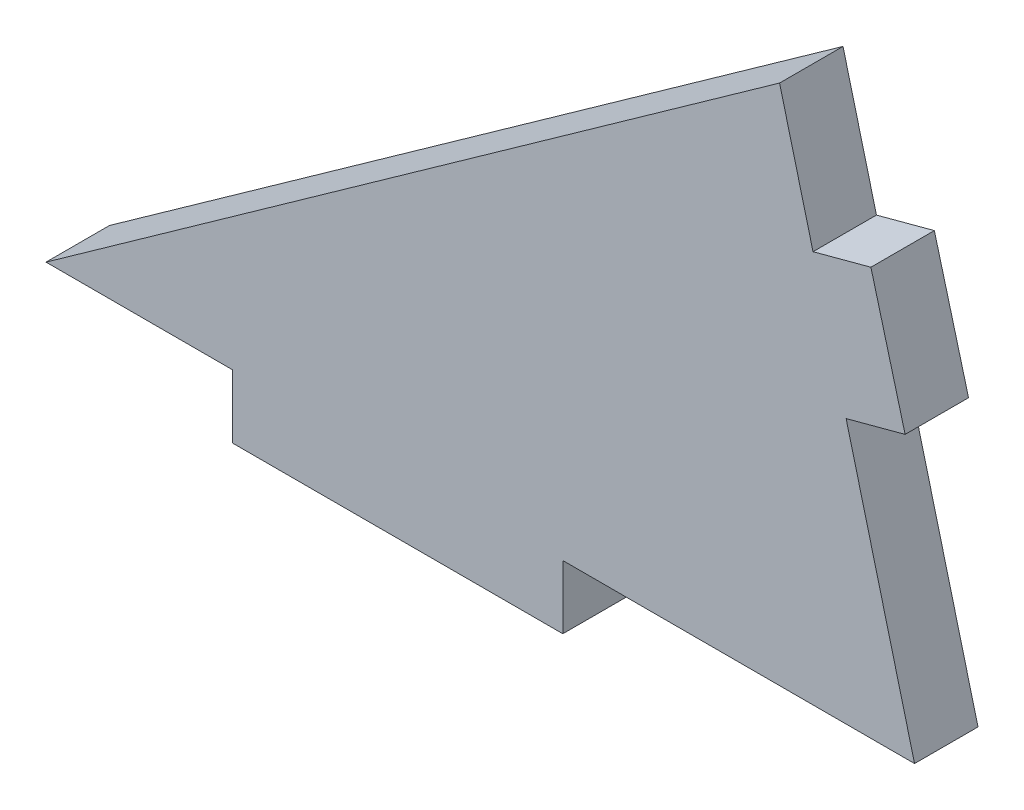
ISO-10303-21;
HEADER;
FILE_DESCRIPTION(('STEP AP214'),'2;1');
FILE_NAME('part.step','',(''),(''),'','','');
FILE_SCHEMA(('AUTOMOTIVE_DESIGN { 1 0 10303 214 1 1 1 1 }'));
ENDSEC;
DATA;
#1=APPLICATION_CONTEXT('core data for automotive mechanical design processes');
#2=APPLICATION_PROTOCOL_DEFINITION('international standard','automotive_design',2000,#1);
#3=PRODUCT_CONTEXT('',#1,'mechanical');
#4=PRODUCT('Part','Part','',(#3));
#5=PRODUCT_RELATED_PRODUCT_CATEGORY('part','',(#4));
#6=PRODUCT_DEFINITION_FORMATION('','',#4);
#7=PRODUCT_DEFINITION_CONTEXT('part definition',#1,'design');
#8=PRODUCT_DEFINITION('design','',#6,#7);
#9=PRODUCT_DEFINITION_SHAPE('','',#8);
#10=(LENGTH_UNIT() NAMED_UNIT(*) SI_UNIT(.MILLI.,.METRE.));
#11=(NAMED_UNIT(*) PLANE_ANGLE_UNIT() SI_UNIT($,.RADIAN.));
#12=(NAMED_UNIT(*) SI_UNIT($,.STERADIAN.) SOLID_ANGLE_UNIT());
#13=UNCERTAINTY_MEASURE_WITH_UNIT(LENGTH_MEASURE(1.E-05),#10,'distance_accuracy_value','');
#14=(GEOMETRIC_REPRESENTATION_CONTEXT(3) GLOBAL_UNCERTAINTY_ASSIGNED_CONTEXT((#13)) GLOBAL_UNIT_ASSIGNED_CONTEXT((#10,
#11,#12)) REPRESENTATION_CONTEXT('',''));
#15=CARTESIAN_POINT('',(0.,0.,0.));
#16=DIRECTION('',(0.,0.,1.));
#17=DIRECTION('',(1.,0.,0.));
#18=AXIS2_PLACEMENT_3D('',#15,#16,#17);
#19=CARTESIAN_POINT('',(13.0177123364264,-1.524,1.524));
#20=DIRECTION('',(1.,0.,0.));
#21=DIRECTION('',(0.,0.,-1.));
#22=AXIS2_PLACEMENT_3D('',#19,#20,#21);
#23=PLANE('',#22);
#24=DIRECTION('',(0.,-1.,0.));
#25=VECTOR('',#24,1.);
#26=CARTESIAN_POINT('',(13.0177123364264,-1.524,0.));
#27=LINE('',#26,#25);
#28=CARTESIAN_POINT('',(13.0177123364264,0.,0.));
#29=VERTEX_POINT('',#28);
#30=CARTESIAN_POINT('',(13.0177123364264,-1.524,0.));
#31=VERTEX_POINT('',#30);
#32=EDGE_CURVE('E150',#29,#31,#27,.T.);
#33=ORIENTED_EDGE('',*,*,#32,.T.);
#34=DIRECTION('',(0.,0.,-1.));
#35=VECTOR('',#34,1.);
#36=CARTESIAN_POINT('',(13.0177123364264,-1.524,1.524));
#37=LINE('',#36,#35);
#38=CARTESIAN_POINT('',(13.0177123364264,-1.524,1.524));
#39=VERTEX_POINT('',#38);
#40=EDGE_CURVE('E11',#39,#31,#37,.T.);
#41=ORIENTED_EDGE('',*,*,#40,.F.);
#42=DIRECTION('',(0.,-1.,0.));
#43=VECTOR('',#42,1.);
#44=CARTESIAN_POINT('',(13.0177123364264,-1.524,1.524));
#45=LINE('',#44,#43);
#46=CARTESIAN_POINT('',(13.0177123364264,0.,1.524));
#47=VERTEX_POINT('',#46);
#48=EDGE_CURVE('E170',#47,#39,#45,.T.);
#49=ORIENTED_EDGE('',*,*,#48,.F.);
#50=DIRECTION('',(0.,0.,-1.));
#51=VECTOR('',#50,1.);
#52=CARTESIAN_POINT('',(13.0177123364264,0.,1.524));
#53=LINE('',#52,#51);
#54=EDGE_CURVE('E146',#47,#29,#53,.T.);
#55=ORIENTED_EDGE('',*,*,#54,.T.);
#56=EDGE_LOOP('',(#33,#41,#49,#55));
#57=FACE_BOUND('',#56,.T.);
#58=ADVANCED_FACE('F36',(#57),#23,.F.);
#59=CARTESIAN_POINT('',(13.0177123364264,-1.524,1.524));
#60=DIRECTION('',(0.,1.,0.));
#61=DIRECTION('',(0.,0.,1.));
#62=AXIS2_PLACEMENT_3D('',#59,#60,#61);
#63=PLANE('',#62);
#64=DIRECTION('',(1.,0.,0.));
#65=VECTOR('',#64,1.);
#66=CARTESIAN_POINT('',(13.0177123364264,-1.524,0.));
#67=LINE('',#66,#65);
#68=CARTESIAN_POINT('',(20.9552123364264,-1.524,0.));
#69=VERTEX_POINT('',#68);
#70=EDGE_CURVE('E153',#31,#69,#67,.T.);
#71=ORIENTED_EDGE('',*,*,#70,.T.);
#72=DIRECTION('',(0.,0.,-1.));
#73=VECTOR('',#72,1.);
#74=CARTESIAN_POINT('',(20.9552123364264,-1.524,1.524));
#75=LINE('',#74,#73);
#76=CARTESIAN_POINT('',(20.9552123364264,-1.524,1.524));
#77=VERTEX_POINT('',#76);
#78=EDGE_CURVE('E44',#77,#69,#75,.T.);
#79=ORIENTED_EDGE('',*,*,#78,.F.);
#80=DIRECTION('',(1.,0.,0.));
#81=VECTOR('',#80,1.);
#82=CARTESIAN_POINT('',(13.0177123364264,-1.524,1.524));
#83=LINE('',#82,#81);
#84=EDGE_CURVE('E104',#39,#77,#83,.T.);
#85=ORIENTED_EDGE('',*,*,#84,.F.);
#86=ORIENTED_EDGE('',*,*,#40,.T.);
#87=EDGE_LOOP('',(#71,#79,#85,#86));
#88=FACE_BOUND('',#87,.T.);
#89=ADVANCED_FACE('F242',(#88),#63,.F.);
#90=CARTESIAN_POINT('',(20.9552123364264,-1.524,1.524));
#91=DIRECTION('',(-1.,0.,0.));
#92=DIRECTION('',(0.,-1.,0.));
#93=AXIS2_PLACEMENT_3D('',#90,#91,#92);
#94=PLANE('',#93);
#95=DIRECTION('',(0.,1.,0.));
#96=VECTOR('',#95,1.);
#97=CARTESIAN_POINT('',(20.9552123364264,-1.524,0.));
#98=LINE('',#97,#96);
#99=CARTESIAN_POINT('',(20.9552123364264,0.,0.));
#100=VERTEX_POINT('',#99);
#101=EDGE_CURVE('E155',#69,#100,#98,.T.);
#102=ORIENTED_EDGE('',*,*,#101,.T.);
#103=DIRECTION('',(0.,0.,-1.));
#104=VECTOR('',#103,1.);
#105=CARTESIAN_POINT('',(20.9552123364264,0.,1.524));
#106=LINE('',#105,#104);
#107=CARTESIAN_POINT('',(20.9552123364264,0.,1.524));
#108=VERTEX_POINT('',#107);
#109=EDGE_CURVE('E186',#108,#100,#106,.T.);
#110=ORIENTED_EDGE('',*,*,#109,.F.);
#111=DIRECTION('',(0.,1.,0.));
#112=VECTOR('',#111,1.);
#113=CARTESIAN_POINT('',(20.9552123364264,-1.524,1.524));
#114=LINE('',#113,#112);
#115=EDGE_CURVE('E194',#77,#108,#114,.T.);
#116=ORIENTED_EDGE('',*,*,#115,.F.);
#117=ORIENTED_EDGE('',*,*,#78,.T.);
#118=EDGE_LOOP('',(#102,#110,#116,#117));
#119=FACE_BOUND('',#118,.T.);
#120=ADVANCED_FACE('F192',(#119),#94,.F.);
#121=CARTESIAN_POINT('',(20.9552123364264,0.,1.524));
#122=DIRECTION('',(0.,1.,0.));
#123=DIRECTION('',(0.,0.,1.));
#124=AXIS2_PLACEMENT_3D('',#121,#122,#123);
#125=PLANE('',#124);
#126=DIRECTION('',(1.,0.,0.));
#127=VECTOR('',#126,1.);
#128=CARTESIAN_POINT('',(20.9552123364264,0.,0.));
#129=LINE('',#128,#127);
#130=CARTESIAN_POINT('',(29.4042823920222,0.,0.));
#131=VERTEX_POINT('',#130);
#132=EDGE_CURVE('E157',#100,#131,#129,.T.);
#133=ORIENTED_EDGE('',*,*,#132,.T.);
#134=DIRECTION('',(0.,0.,-1.));
#135=VECTOR('',#134,1.);
#136=CARTESIAN_POINT('',(29.4042823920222,0.,1.524));
#137=LINE('',#136,#135);
#138=CARTESIAN_POINT('',(29.4042823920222,0.,1.524));
#139=VERTEX_POINT('',#138);
#140=EDGE_CURVE('E183',#139,#131,#137,.T.);
#141=ORIENTED_EDGE('',*,*,#140,.F.);
#142=DIRECTION('',(1.,0.,0.));
#143=VECTOR('',#142,1.);
#144=CARTESIAN_POINT('',(20.9552123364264,0.,1.524));
#145=LINE('',#144,#143);
#146=EDGE_CURVE('E212',#108,#139,#145,.T.);
#147=ORIENTED_EDGE('',*,*,#146,.F.);
#148=ORIENTED_EDGE('',*,*,#109,.T.);
#149=EDGE_LOOP('',(#133,#141,#147,#148));
#150=FACE_BOUND('',#149,.T.);
#151=ADVANCED_FACE('F203',(#150),#125,.F.);
#152=CARTESIAN_POINT('',(29.4042823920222,0.,1.524));
#153=DIRECTION('',(-0.96813587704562,-0.25042548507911,0.));
#154=DIRECTION('',(0.25042548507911,-0.96813587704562,0.));
#155=AXIS2_PLACEMENT_3D('',#152,#153,#154);
#156=PLANE('',#155);
#157=DIRECTION('',(-0.25042548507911,0.96813587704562,0.));
#158=VECTOR('',#157,1.);
#159=CARTESIAN_POINT('',(29.4042823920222,0.,0.));
#160=LINE('',#159,#158);
#161=CARTESIAN_POINT('',(27.7603764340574,6.3552810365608,0.));
#162=VERTEX_POINT('',#161);
#163=EDGE_CURVE('E159',#131,#162,#160,.T.);
#164=ORIENTED_EDGE('',*,*,#163,.T.);
#165=DIRECTION('',(0.,0.,-1.));
#166=VECTOR('',#165,1.);
#167=CARTESIAN_POINT('',(27.7603764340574,6.3552810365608,1.524));
#168=LINE('',#167,#166);
#169=CARTESIAN_POINT('',(27.7603764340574,6.3552810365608,1.524));
#170=VERTEX_POINT('',#169);
#171=EDGE_CURVE('E180',#170,#162,#168,.T.);
#172=ORIENTED_EDGE('',*,*,#171,.F.);
#173=DIRECTION('',(-0.25042548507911,0.96813587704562,0.));
#174=VECTOR('',#173,1.);
#175=CARTESIAN_POINT('',(29.4042823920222,0.,1.524));
#176=LINE('',#175,#174);
#177=EDGE_CURVE('E209',#139,#170,#176,.T.);
#178=ORIENTED_EDGE('',*,*,#177,.F.);
#179=ORIENTED_EDGE('',*,*,#140,.T.);
#180=EDGE_LOOP('',(#164,#172,#178,#179));
#181=FACE_BOUND('',#180,.T.);
#182=ADVANCED_FACE('F207',(#181),#156,.F.);
#183=CARTESIAN_POINT('',(27.7603764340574,6.3552810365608,1.524));
#184=DIRECTION('',(-0.25881904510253,0.965925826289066,0.));
#185=DIRECTION('',(-0.965925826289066,-0.25881904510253,0.));
#186=AXIS2_PLACEMENT_3D('',#183,#184,#185);
#187=PLANE('',#186);
#188=DIRECTION('',(0.965925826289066,0.25881904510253,0.));
#189=VECTOR('',#188,1.);
#190=CARTESIAN_POINT('',(27.7603764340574,6.3552810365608,0.));
#191=LINE('',#190,#189);
#192=CARTESIAN_POINT('',(29.1774122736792,6.73497464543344,0.));
#193=VERTEX_POINT('',#192);
#194=EDGE_CURVE('E161',#162,#193,#191,.T.);
#195=ORIENTED_EDGE('',*,*,#194,.T.);
#196=DIRECTION('',(0.,0.,-1.));
#197=VECTOR('',#196,1.);
#198=CARTESIAN_POINT('',(29.1774122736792,6.73497464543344,1.524));
#199=LINE('',#198,#197);
#200=CARTESIAN_POINT('',(29.1774122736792,6.73497464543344,1.524));
#201=VERTEX_POINT('',#200);
#202=EDGE_CURVE('E177',#201,#193,#199,.T.);
#203=ORIENTED_EDGE('',*,*,#202,.F.);
#204=DIRECTION('',(0.965925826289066,0.25881904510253,0.));
#205=VECTOR('',#204,1.);
#206=CARTESIAN_POINT('',(27.7603764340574,6.3552810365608,1.524));
#207=LINE('',#206,#205);
#208=EDGE_CURVE('E211',#170,#201,#207,.T.);
#209=ORIENTED_EDGE('',*,*,#208,.F.);
#210=ORIENTED_EDGE('',*,*,#171,.T.);
#211=EDGE_LOOP('',(#195,#203,#209,#210));
#212=FACE_BOUND('',#211,.T.);
#213=ADVANCED_FACE('F255',(#212),#187,.F.);
#214=CARTESIAN_POINT('',(29.1774122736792,6.73497464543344,1.524));
#215=DIRECTION('',(-0.965925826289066,-0.258819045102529,0.));
#216=DIRECTION('',(0.258819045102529,-0.965925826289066,0.));
#217=AXIS2_PLACEMENT_3D('',#214,#215,#216);
#218=PLANE('',#217);
#219=DIRECTION('',(-0.258819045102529,0.965925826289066,0.));
#220=VECTOR('',#219,1.);
#221=CARTESIAN_POINT('',(29.1774122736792,6.73497464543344,0.));
#222=LINE('',#221,#220);
#223=CARTESIAN_POINT('',(28.3556618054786,9.80178914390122,0.));
#224=VERTEX_POINT('',#223);
#225=EDGE_CURVE('E163',#193,#224,#222,.T.);
#226=ORIENTED_EDGE('',*,*,#225,.T.);
#227=DIRECTION('',(0.,0.,-1.));
#228=VECTOR('',#227,1.);
#229=CARTESIAN_POINT('',(28.3556618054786,9.80178914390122,1.524));
#230=LINE('',#229,#228);
#231=CARTESIAN_POINT('',(28.3556618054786,9.80178914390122,1.524));
#232=VERTEX_POINT('',#231);
#233=EDGE_CURVE('E174',#232,#224,#230,.T.);
#234=ORIENTED_EDGE('',*,*,#233,.F.);
#235=DIRECTION('',(-0.258819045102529,0.965925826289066,0.));
#236=VECTOR('',#235,1.);
#237=CARTESIAN_POINT('',(29.1774122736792,6.73497464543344,1.524));
#238=LINE('',#237,#236);
#239=EDGE_CURVE('E214',#201,#232,#238,.T.);
#240=ORIENTED_EDGE('',*,*,#239,.F.);
#241=ORIENTED_EDGE('',*,*,#202,.T.);
#242=EDGE_LOOP('',(#226,#234,#240,#241));
#243=FACE_BOUND('',#242,.T.);
#244=ADVANCED_FACE('F223',(#243),#218,.F.);
#245=CARTESIAN_POINT('',(26.9652455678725,9.42922823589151,1.524));
#246=DIRECTION('',(0.258819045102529,-0.965925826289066,0.));
#247=DIRECTION('',(0.965925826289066,0.258819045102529,0.));
#248=AXIS2_PLACEMENT_3D('',#245,#246,#247);
#249=PLANE('',#248);
#250=DIRECTION('',(-0.965925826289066,-0.258819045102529,0.));
#251=VECTOR('',#250,1.);
#252=CARTESIAN_POINT('',(26.9652455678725,9.42922823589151,0.));
#253=LINE('',#252,#251);
#254=CARTESIAN_POINT('',(26.9652455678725,9.42922823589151,0.));
#255=VERTEX_POINT('',#254);
#256=EDGE_CURVE('E165',#224,#255,#253,.T.);
#257=ORIENTED_EDGE('',*,*,#256,.T.);
#258=DIRECTION('',(0.,0.,-1.));
#259=VECTOR('',#258,1.);
#260=CARTESIAN_POINT('',(26.9652455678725,9.42922823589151,1.524));
#261=LINE('',#260,#259);
#262=CARTESIAN_POINT('',(26.9652455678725,9.42922823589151,1.524));
#263=VERTEX_POINT('',#262);
#264=EDGE_CURVE('E141',#263,#255,#261,.T.);
#265=ORIENTED_EDGE('',*,*,#264,.F.);
#266=DIRECTION('',(-0.965925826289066,-0.258819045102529,0.));
#267=VECTOR('',#266,1.);
#268=CARTESIAN_POINT('',(26.9652455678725,9.42922823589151,1.524));
#269=LINE('',#268,#267);
#270=EDGE_CURVE('E132',#232,#263,#269,.T.);
#271=ORIENTED_EDGE('',*,*,#270,.F.);
#272=ORIENTED_EDGE('',*,*,#233,.T.);
#273=EDGE_LOOP('',(#257,#265,#271,#272));
#274=FACE_BOUND('',#273,.T.);
#275=ADVANCED_FACE('F227',(#274),#249,.F.);
#276=CARTESIAN_POINT('',(26.9652455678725,9.42922823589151,1.524));
#277=DIRECTION('',(-0.968135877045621,-0.250425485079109,0.));
#278=DIRECTION('',(0.250425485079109,-0.968135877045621,0.));
#279=AXIS2_PLACEMENT_3D('',#276,#277,#278);
#280=PLANE('',#279);
#281=DIRECTION('',(-0.250425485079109,0.968135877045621,0.));
#282=VECTOR('',#281,1.);
#283=CARTESIAN_POINT('',(26.9652455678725,9.42922823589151,0.));
#284=LINE('',#283,#282);
#285=CARTESIAN_POINT('',(26.1616759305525,12.5357994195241,0.));
#286=VERTEX_POINT('',#285);
#287=EDGE_CURVE('E140',#255,#286,#284,.T.);
#288=ORIENTED_EDGE('',*,*,#287,.T.);
#289=DIRECTION('',(0.,0.,-1.));
#290=VECTOR('',#289,1.);
#291=CARTESIAN_POINT('',(26.1616759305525,12.5357994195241,1.524));
#292=LINE('',#291,#290);
#293=CARTESIAN_POINT('',(26.1616759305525,12.5357994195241,1.524));
#294=VERTEX_POINT('',#293);
#295=EDGE_CURVE('E137',#294,#286,#292,.T.);
#296=ORIENTED_EDGE('',*,*,#295,.F.);
#297=DIRECTION('',(-0.250425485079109,0.968135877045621,0.));
#298=VECTOR('',#297,1.);
#299=CARTESIAN_POINT('',(26.9652455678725,9.42922823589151,1.524));
#300=LINE('',#299,#298);
#301=EDGE_CURVE('E126',#263,#294,#300,.T.);
#302=ORIENTED_EDGE('',*,*,#301,.F.);
#303=ORIENTED_EDGE('',*,*,#264,.T.);
#304=EDGE_LOOP('',(#288,#296,#302,#303));
#305=FACE_BOUND('',#304,.T.);
#306=ADVANCED_FACE('F138',(#305),#280,.F.);
#307=CARTESIAN_POINT('',(26.1616759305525,12.5357994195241,1.524));
#308=DIRECTION('',(0.579681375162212,-0.814843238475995,0.));
#309=DIRECTION('',(0.814843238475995,0.579681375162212,0.));
#310=AXIS2_PLACEMENT_3D('',#307,#308,#309);
#311=PLANE('',#310);
#312=DIRECTION('',(-0.814843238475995,-0.579681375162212,0.));
#313=VECTOR('',#312,1.);
#314=CARTESIAN_POINT('',(26.1616759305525,12.5357994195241,0.));
#315=LINE('',#314,#313);
#316=CARTESIAN_POINT('',(8.54042426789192,0.,0.));
#317=VERTEX_POINT('',#316);
#318=EDGE_CURVE('E90',#286,#317,#315,.T.);
#319=ORIENTED_EDGE('',*,*,#318,.T.);
#320=DIRECTION('',(0.,0.,-1.));
#321=VECTOR('',#320,1.);
#322=CARTESIAN_POINT('',(8.54042426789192,0.,1.524));
#323=LINE('',#322,#321);
#324=CARTESIAN_POINT('',(8.54042426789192,0.,1.524));
#325=VERTEX_POINT('',#324);
#326=EDGE_CURVE('E142',#325,#317,#323,.T.);
#327=ORIENTED_EDGE('',*,*,#326,.F.);
#328=DIRECTION('',(-0.814843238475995,-0.579681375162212,0.));
#329=VECTOR('',#328,1.);
#330=CARTESIAN_POINT('',(26.1616759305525,12.5357994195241,1.524));
#331=LINE('',#330,#329);
#332=EDGE_CURVE('E130',#294,#325,#331,.T.);
#333=ORIENTED_EDGE('',*,*,#332,.F.);
#334=ORIENTED_EDGE('',*,*,#295,.T.);
#335=EDGE_LOOP('',(#319,#327,#333,#334));
#336=FACE_BOUND('',#335,.T.);
#337=ADVANCED_FACE('F144',(#336),#311,.F.);
#338=CARTESIAN_POINT('',(13.0177123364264,0.,1.524));
#339=DIRECTION('',(0.,1.,0.));
#340=DIRECTION('',(0.,0.,1.));
#341=AXIS2_PLACEMENT_3D('',#338,#339,#340);
#342=PLANE('',#341);
#343=DIRECTION('',(1.,0.,0.));
#344=VECTOR('',#343,1.);
#345=CARTESIAN_POINT('',(13.0177123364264,0.,0.));
#346=LINE('',#345,#344);
#347=EDGE_CURVE('E96',#317,#29,#346,.T.);
#348=ORIENTED_EDGE('',*,*,#347,.T.);
#349=ORIENTED_EDGE('',*,*,#54,.F.);
#350=DIRECTION('',(1.,0.,0.));
#351=VECTOR('',#350,1.);
#352=CARTESIAN_POINT('',(13.0177123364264,0.,1.524));
#353=LINE('',#352,#351);
#354=EDGE_CURVE('E52',#325,#47,#353,.T.);
#355=ORIENTED_EDGE('',*,*,#354,.F.);
#356=ORIENTED_EDGE('',*,*,#326,.T.);
#357=EDGE_LOOP('',(#348,#349,#355,#356));
#358=FACE_BOUND('',#357,.T.);
#359=ADVANCED_FACE('F231',(#358),#342,.F.);
#360=CARTESIAN_POINT('',(0.,0.,1.524));
#361=DIRECTION('',(0.,0.,1.));
#362=DIRECTION('',(1.,0.,0.));
#363=AXIS2_PLACEMENT_3D('',#360,#361,#362);
#364=PLANE('',#363);
#365=ORIENTED_EDGE('',*,*,#48,.T.);
#366=ORIENTED_EDGE('',*,*,#84,.T.);
#367=ORIENTED_EDGE('',*,*,#115,.T.);
#368=ORIENTED_EDGE('',*,*,#146,.T.);
#369=ORIENTED_EDGE('',*,*,#177,.T.);
#370=ORIENTED_EDGE('',*,*,#208,.T.);
#371=ORIENTED_EDGE('',*,*,#239,.T.);
#372=ORIENTED_EDGE('',*,*,#270,.T.);
#373=ORIENTED_EDGE('',*,*,#301,.T.);
#374=ORIENTED_EDGE('',*,*,#332,.T.);
#375=ORIENTED_EDGE('',*,*,#354,.T.);
#376=EDGE_LOOP('',(#365,#366,#367,#368,#369,#370,#371,#372,#373,#374,#375));
#377=FACE_BOUND('',#376,.T.);
#378=ADVANCED_FACE('F128',(#377),#364,.T.);
#379=CARTESIAN_POINT('',(0.,0.,0.));
#380=DIRECTION('',(0.,0.,1.));
#381=DIRECTION('',(1.,0.,0.));
#382=AXIS2_PLACEMENT_3D('',#379,#380,#381);
#383=PLANE('',#382);
#384=ORIENTED_EDGE('',*,*,#32,.F.);
#385=ORIENTED_EDGE('',*,*,#347,.F.);
#386=ORIENTED_EDGE('',*,*,#318,.F.);
#387=ORIENTED_EDGE('',*,*,#287,.F.);
#388=ORIENTED_EDGE('',*,*,#256,.F.);
#389=ORIENTED_EDGE('',*,*,#225,.F.);
#390=ORIENTED_EDGE('',*,*,#194,.F.);
#391=ORIENTED_EDGE('',*,*,#163,.F.);
#392=ORIENTED_EDGE('',*,*,#132,.F.);
#393=ORIENTED_EDGE('',*,*,#101,.F.);
#394=ORIENTED_EDGE('',*,*,#70,.F.);
#395=EDGE_LOOP('',(#384,#385,#386,#387,#388,#389,#390,#391,#392,#393,#394));
#396=FACE_BOUND('',#395,.T.);
#397=ADVANCED_FACE('F198',(#396),#383,.F.);
#398=CLOSED_SHELL('',(#58,#89,#120,#151,#182,#213,#244,#275,#306,#337,#359,#378,#397));
#399=MANIFOLD_SOLID_BREP('B2',#398);
#400=ADVANCED_BREP_SHAPE_REPRESENTATION('',(#18,#399),#14);
#401=SHAPE_DEFINITION_REPRESENTATION(#9,#400);
ENDSEC;
END-ISO-10303-21;
